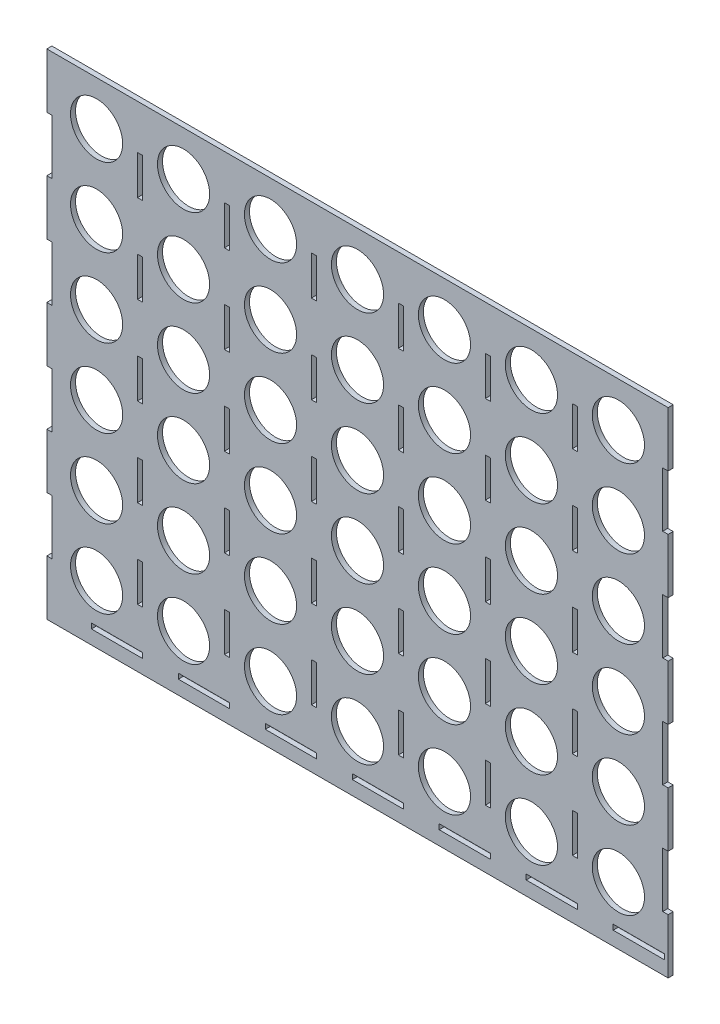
from build123d import *

# Parameters (mm, degrees)
ESQUISSE1_R        = 15
ESQUISSE1_W        = 29.5
ESQUISSE1_H        = 3
ESQUISSE1_W_2      = 3
ESQUISSE1_H_2      = 22.5
BOSS_EXTRU_1_DEPTH = 2.9


with BuildPart() as part:
    # Esquisse1 → Boss.-Extru.1 (new body)
    with BuildSketch(Plane.XY):
        Polygon((-178.6, 142), (178.6, 142), (178.6, 110.444444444), (175.5, 110.444444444), (175.5, 78.888888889), (178.6, 78.888888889), (178.6, 47.333333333), (175.5, 47.333333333), (175.5, 15.777777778), (178.6, 15.777777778), (178.6, -15.777777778), (175.5, -15.777777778), (175.5, -47.333333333), (178.6, -47.333333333), (178.6, -78.888888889), (175.5, -78.888888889), (175.5, -110.444444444), (178.6, -110.444444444), (178.6, -142), (-178.6, -142), (-178.6, -110.444444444), (-175.5, -110.444444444), (-175.5, -78.888888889), (-178.6, -78.888888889), (-178.6, -47.333333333), (-175.5, -47.333333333), (-175.5, -15.777777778), (-178.6, -15.777777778), (-178.6, 15.777777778), (-175.5, 15.777777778), (-175.5, 47.333333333), (-178.6, 47.333333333), (-178.6, 78.888888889), (-175.5, 78.888888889), (-175.5, 110.444444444), (-178.6, 110.444444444), align=None)
        with Locations((-150, -108.5)):
            Circle(ESQUISSE1_R, mode=Mode.SUBTRACT)
        with Locations((-100, -108.5)):
            Circle(ESQUISSE1_R, mode=Mode.SUBTRACT)
        with Locations((-50, -108.5)):
            Circle(ESQUISSE1_R, mode=Mode.SUBTRACT)
        with Locations((0, -108.5)):
            Circle(ESQUISSE1_R, mode=Mode.SUBTRACT)
        with Locations((50, -108.5)):
            Circle(ESQUISSE1_R, mode=Mode.SUBTRACT)
        with Locations((100, -108.5)):
            Circle(ESQUISSE1_R, mode=Mode.SUBTRACT)
        with Locations((150, -108.5)):
            Circle(ESQUISSE1_R, mode=Mode.SUBTRACT)
        with Locations((-150, -63.5)):
            Circle(ESQUISSE1_R, mode=Mode.SUBTRACT)
        with Locations((-150, -18.5)):
            Circle(ESQUISSE1_R, mode=Mode.SUBTRACT)
        with Locations((-150, 26.5)):
            Circle(ESQUISSE1_R, mode=Mode.SUBTRACT)
        with Locations((-150, 71.5)):
            Circle(ESQUISSE1_R, mode=Mode.SUBTRACT)
        with Locations((-150, 116.5)):
            Circle(ESQUISSE1_R, mode=Mode.SUBTRACT)
        with Locations((-100, -63.5)):
            Circle(ESQUISSE1_R, mode=Mode.SUBTRACT)
        with Locations((-100, -18.5)):
            Circle(ESQUISSE1_R, mode=Mode.SUBTRACT)
        with Locations((-100, 26.5)):
            Circle(ESQUISSE1_R, mode=Mode.SUBTRACT)
        with Locations((-100, 71.5)):
            Circle(ESQUISSE1_R, mode=Mode.SUBTRACT)
        with Locations((-100, 116.5)):
            Circle(ESQUISSE1_R, mode=Mode.SUBTRACT)
        with Locations((-50, -63.5)):
            Circle(ESQUISSE1_R, mode=Mode.SUBTRACT)
        with Locations((-50, -18.5)):
            Circle(ESQUISSE1_R, mode=Mode.SUBTRACT)
        with Locations((-50, 26.5)):
            Circle(ESQUISSE1_R, mode=Mode.SUBTRACT)
        with Locations((-50, 71.5)):
            Circle(ESQUISSE1_R, mode=Mode.SUBTRACT)
        with Locations((-50, 116.5)):
            Circle(ESQUISSE1_R, mode=Mode.SUBTRACT)
        with Locations((0, -63.5)):
            Circle(ESQUISSE1_R, mode=Mode.SUBTRACT)
        with Locations((0, -18.5)):
            Circle(ESQUISSE1_R, mode=Mode.SUBTRACT)
        with Locations((0, 26.5)):
            Circle(ESQUISSE1_R, mode=Mode.SUBTRACT)
        with Locations((0, 71.5)):
            Circle(ESQUISSE1_R, mode=Mode.SUBTRACT)
        with Locations((0, 116.5)):
            Circle(ESQUISSE1_R, mode=Mode.SUBTRACT)
        with Locations((50, -63.5)):
            Circle(ESQUISSE1_R, mode=Mode.SUBTRACT)
        with Locations((50, -18.5)):
            Circle(ESQUISSE1_R, mode=Mode.SUBTRACT)
        with Locations((50, 26.5)):
            Circle(ESQUISSE1_R, mode=Mode.SUBTRACT)
        with Locations((50, 71.5)):
            Circle(ESQUISSE1_R, mode=Mode.SUBTRACT)
        with Locations((50, 116.5)):
            Circle(ESQUISSE1_R, mode=Mode.SUBTRACT)
        with Locations((100, -63.5)):
            Circle(ESQUISSE1_R, mode=Mode.SUBTRACT)
        with Locations((100, -18.5)):
            Circle(ESQUISSE1_R, mode=Mode.SUBTRACT)
        with Locations((100, 26.5)):
            Circle(ESQUISSE1_R, mode=Mode.SUBTRACT)
        with Locations((100, 71.5)):
            Circle(ESQUISSE1_R, mode=Mode.SUBTRACT)
        with Locations((100, 116.5)):
            Circle(ESQUISSE1_R, mode=Mode.SUBTRACT)
        with Locations((150, -63.5)):
            Circle(ESQUISSE1_R, mode=Mode.SUBTRACT)
        with Locations((150, -18.5)):
            Circle(ESQUISSE1_R, mode=Mode.SUBTRACT)
        with Locations((150, 26.5)):
            Circle(ESQUISSE1_R, mode=Mode.SUBTRACT)
        with Locations((150, 71.5)):
            Circle(ESQUISSE1_R, mode=Mode.SUBTRACT)
        with Locations((150, 116.5)):
            Circle(ESQUISSE1_R, mode=Mode.SUBTRACT)
        with Locations((-138.25, -132.5)):
            Rectangle(ESQUISSE1_W, ESQUISSE1_H, mode=Mode.SUBTRACT)
        with Locations((-125, -97.25)):
            Rectangle(ESQUISSE1_W_2, ESQUISSE1_H_2, mode=Mode.SUBTRACT)
        with Locations((-125, -46.625)):
            Rectangle(ESQUISSE1_W_2, ESQUISSE1_H_2, mode=Mode.SUBTRACT)
        with Locations((-125, 4)):
            Rectangle(ESQUISSE1_W_2, ESQUISSE1_H_2, mode=Mode.SUBTRACT)
        with Locations((-125, 54.625)):
            Rectangle(ESQUISSE1_W_2, ESQUISSE1_H_2, mode=Mode.SUBTRACT)
        with Locations((-125, 105.25)):
            Rectangle(ESQUISSE1_W_2, ESQUISSE1_H_2, mode=Mode.SUBTRACT)
        with Locations((-75, -97.25)):
            Rectangle(ESQUISSE1_W_2, ESQUISSE1_H_2, mode=Mode.SUBTRACT)
        with Locations((-75, -46.625)):
            Rectangle(ESQUISSE1_W_2, ESQUISSE1_H_2, mode=Mode.SUBTRACT)
        with Locations((-75, 4)):
            Rectangle(ESQUISSE1_W_2, ESQUISSE1_H_2, mode=Mode.SUBTRACT)
        with Locations((-75, 54.625)):
            Rectangle(ESQUISSE1_W_2, ESQUISSE1_H_2, mode=Mode.SUBTRACT)
        with Locations((-75, 105.25)):
            Rectangle(ESQUISSE1_W_2, ESQUISSE1_H_2, mode=Mode.SUBTRACT)
        with Locations((-25, -97.25)):
            Rectangle(ESQUISSE1_W_2, ESQUISSE1_H_2, mode=Mode.SUBTRACT)
        with Locations((-25, -46.625)):
            Rectangle(ESQUISSE1_W_2, ESQUISSE1_H_2, mode=Mode.SUBTRACT)
        with Locations((-25, 4)):
            Rectangle(ESQUISSE1_W_2, ESQUISSE1_H_2, mode=Mode.SUBTRACT)
        with Locations((-25, 54.625)):
            Rectangle(ESQUISSE1_W_2, ESQUISSE1_H_2, mode=Mode.SUBTRACT)
        with Locations((-25, 105.25)):
            Rectangle(ESQUISSE1_W_2, ESQUISSE1_H_2, mode=Mode.SUBTRACT)
        with Locations((25, -97.25)):
            Rectangle(ESQUISSE1_W_2, ESQUISSE1_H_2, mode=Mode.SUBTRACT)
        with Locations((25, -46.625)):
            Rectangle(ESQUISSE1_W_2, ESQUISSE1_H_2, mode=Mode.SUBTRACT)
        with Locations((25, 4)):
            Rectangle(ESQUISSE1_W_2, ESQUISSE1_H_2, mode=Mode.SUBTRACT)
        with Locations((25, 54.625)):
            Rectangle(ESQUISSE1_W_2, ESQUISSE1_H_2, mode=Mode.SUBTRACT)
        with Locations((25, 105.25)):
            Rectangle(ESQUISSE1_W_2, ESQUISSE1_H_2, mode=Mode.SUBTRACT)
        with Locations((75, -97.25)):
            Rectangle(ESQUISSE1_W_2, ESQUISSE1_H_2, mode=Mode.SUBTRACT)
        with Locations((75, -46.625)):
            Rectangle(ESQUISSE1_W_2, ESQUISSE1_H_2, mode=Mode.SUBTRACT)
        with Locations((75, 4)):
            Rectangle(ESQUISSE1_W_2, ESQUISSE1_H_2, mode=Mode.SUBTRACT)
        with Locations((75, 54.625)):
            Rectangle(ESQUISSE1_W_2, ESQUISSE1_H_2, mode=Mode.SUBTRACT)
        with Locations((75, 105.25)):
            Rectangle(ESQUISSE1_W_2, ESQUISSE1_H_2, mode=Mode.SUBTRACT)
        with Locations((125, -97.25)):
            Rectangle(ESQUISSE1_W_2, ESQUISSE1_H_2, mode=Mode.SUBTRACT)
        with Locations((125, -46.625)):
            Rectangle(ESQUISSE1_W_2, ESQUISSE1_H_2, mode=Mode.SUBTRACT)
        with Locations((125, 4)):
            Rectangle(ESQUISSE1_W_2, ESQUISSE1_H_2, mode=Mode.SUBTRACT)
        with Locations((125, 54.625)):
            Rectangle(ESQUISSE1_W_2, ESQUISSE1_H_2, mode=Mode.SUBTRACT)
        with Locations((125, 105.25)):
            Rectangle(ESQUISSE1_W_2, ESQUISSE1_H_2, mode=Mode.SUBTRACT)
        with Locations((-88.25, -132.5)):
            Rectangle(ESQUISSE1_W, ESQUISSE1_H, mode=Mode.SUBTRACT)
        with Locations((-38.25, -132.5)):
            Rectangle(ESQUISSE1_W, ESQUISSE1_H, mode=Mode.SUBTRACT)
        with Locations((11.75, -132.5)):
            Rectangle(ESQUISSE1_W, ESQUISSE1_H, mode=Mode.SUBTRACT)
        with Locations((61.75, -132.5)):
            Rectangle(ESQUISSE1_W, ESQUISSE1_H, mode=Mode.SUBTRACT)
        with Locations((111.75, -132.5)):
            Rectangle(ESQUISSE1_W, ESQUISSE1_H, mode=Mode.SUBTRACT)
        with Locations((161.75, -132.5)):
            Rectangle(ESQUISSE1_W, ESQUISSE1_H, mode=Mode.SUBTRACT)
    extrude(amount=BOSS_EXTRU_1_DEPTH)


solid = part.part
